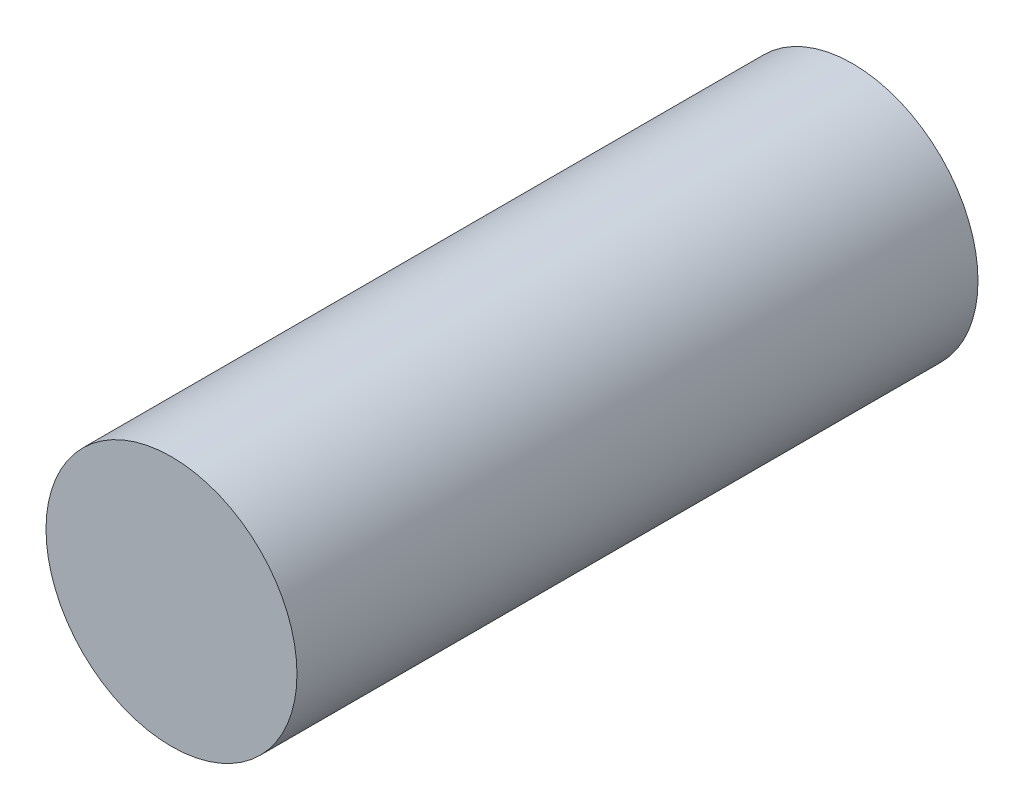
from build123d import *

# Parameters (mm, degrees)
SKETCH1_W = 105.029
SKETCH1_H = 570


with BuildPart() as part:
    # Sketch1 → Revolve1 (revolve)
    with BuildSketch(Plane.XZ.offset(-45.362648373), mode=Mode.PRIVATE) as revolve1_sk:
        with Locations((-13.292283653, 285)):
            Rectangle(SKETCH1_W, SKETCH1_H)
    revolve(revolve1_sk.sketch.rotate(Axis((-65.806783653, 45.362648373, 570), (0, 0, -1)), 180), axis=Axis((-65.806783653, 45.362648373, 570), (0, 0, -1)))


solid = part.part
